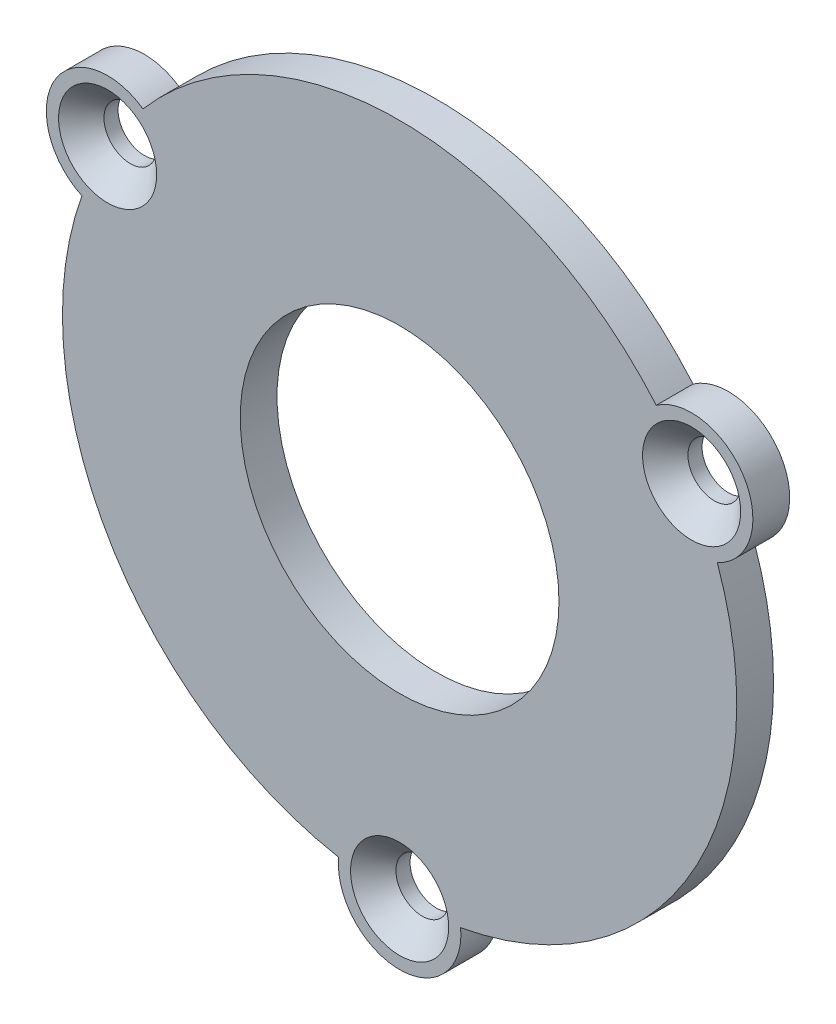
from build123d import *

# Parameters (mm, degrees)
ESQUISSE1_R                  = 27.5
ESQUISSE1_R_2                = 13
EXTRUSION1_DEPTH             = 3
ESQUISSE4_R                  = 5
EXTRUSION2_DEPTH             = 3
R_P_TITION_CIRCULAIRE1_COUNT = 3


with BuildPart() as part:
    # Esquisse1 → Extrusion1 (new body)
    with BuildSketch(Plane.XY):
        Circle(ESQUISSE1_R)
        Circle(ESQUISSE1_R_2, mode=Mode.SUBTRACT)
    extrude(amount=EXTRUSION1_DEPTH)

    # Esquisse4 → Extrusion2 (add)
    with BuildSketch(Plane.XY):
        with Locations((0, -27.5)):
            Circle(ESQUISSE4_R)
    extrusion2 = extrude(amount=EXTRUSION2_DEPTH)

    # Esquisse5 → Fraisage pour vis _ t_te frais_e M42 (revolve, cut)
    with BuildSketch(Plane(origin=(0, -27.5, 3), x_dir=(0, -1, 0), z_dir=(1, 0, 0))):
        Polygon((0, 0), (0, 3), (2.15, 3), (2.15, 1.85), (4, 0), align=None)
    fraisage_pour_vis_t_te_frais_e_m42 = revolve(axis=Axis((0, -27.5, 9.35), (0, 0, -1)), mode=Mode.SUBTRACT)

    # R_p_tition circulaire1: Extrusion2, Fraisage pour vis _ t_te frais_e M42 ×3 about axis
    r_p_tition_circulaire1_axis = Axis((0, 0, 0), (0, 0, 1))
    add([extrusion2.rotate(r_p_tition_circulaire1_axis, i * 360 / R_P_TITION_CIRCULAIRE1_COUNT) for i in range(1, R_P_TITION_CIRCULAIRE1_COUNT)])
    add([fraisage_pour_vis_t_te_frais_e_m42.rotate(r_p_tition_circulaire1_axis, i * 360 / R_P_TITION_CIRCULAIRE1_COUNT) for i in range(1, R_P_TITION_CIRCULAIRE1_COUNT)], mode=Mode.SUBTRACT)


solid = part.part
